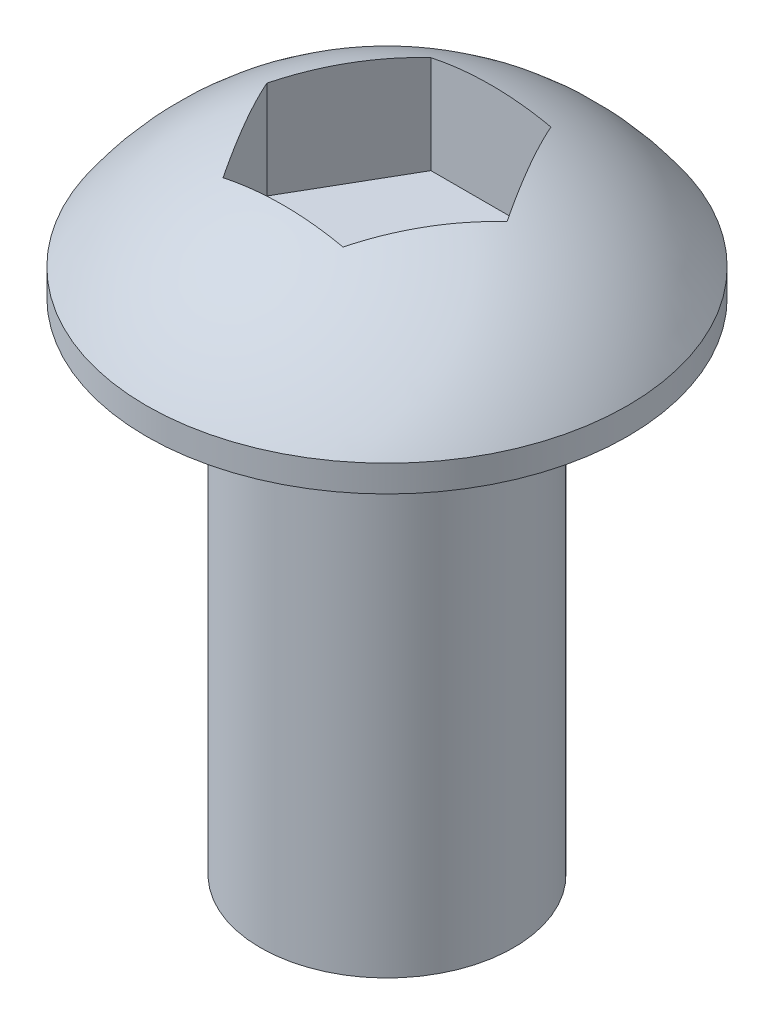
from build123d import *

# Parameters (mm, degrees)
CUT_EXTRUDE1_DEPTH  = 2.032
SKETCH3_R           = 2.413
BOSS_EXTRUDE1_DEPTH = 9.525


with BuildPart() as part:
    # Sketch1 → Base-Revolve (revolve)
    with BuildSketch(Plane.XY, mode=Mode.PRIVATE) as base_revolve_sk:
        with BuildLine():
            Line((0, 0), (4.5847, 0))
            Line((4.5847, 0), (4.5847, 0.508))
            ThreePointArc((4.5847, 0.508), (3.383565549, 1.758844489), (1.848376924, 2.5654))
            Line((1.848376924, 2.5654), (0, 2.5654))
            Line((0, 2.5654), (0, 0))
        make_face()
    revolve(base_revolve_sk.sketch.rotate(Axis((0, -0.666297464, 0), (0, -1, 0)), 90), axis=Axis((0, -0.666297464, 0), (0, -1, 0)))

    # Sketch2 → Cut-Extrude1 (cut)
    with BuildSketch(Plane(origin=(0, 2.5654, 0), x_dir=(-1, 0, 0), z_dir=(0, 1, 0))):
        Polygon((1.143846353, -1.9812), (2.287692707, 0), (1.143846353, 1.9812), (-1.143846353, 1.9812), (-2.287692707, 0), (-1.143846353, -1.9812), align=None)
    extrude(amount=-CUT_EXTRUDE1_DEPTH, mode=Mode.SUBTRACT)

    # Sketch3 → Boss-Extrude1 (add)
    with BuildSketch(Plane.XZ):
        with Locations(Location((0, 0, 0), (0, 0, 90))):
            Circle(SKETCH3_R)
    extrude(amount=BOSS_EXTRUDE1_DEPTH)


solid = part.part
